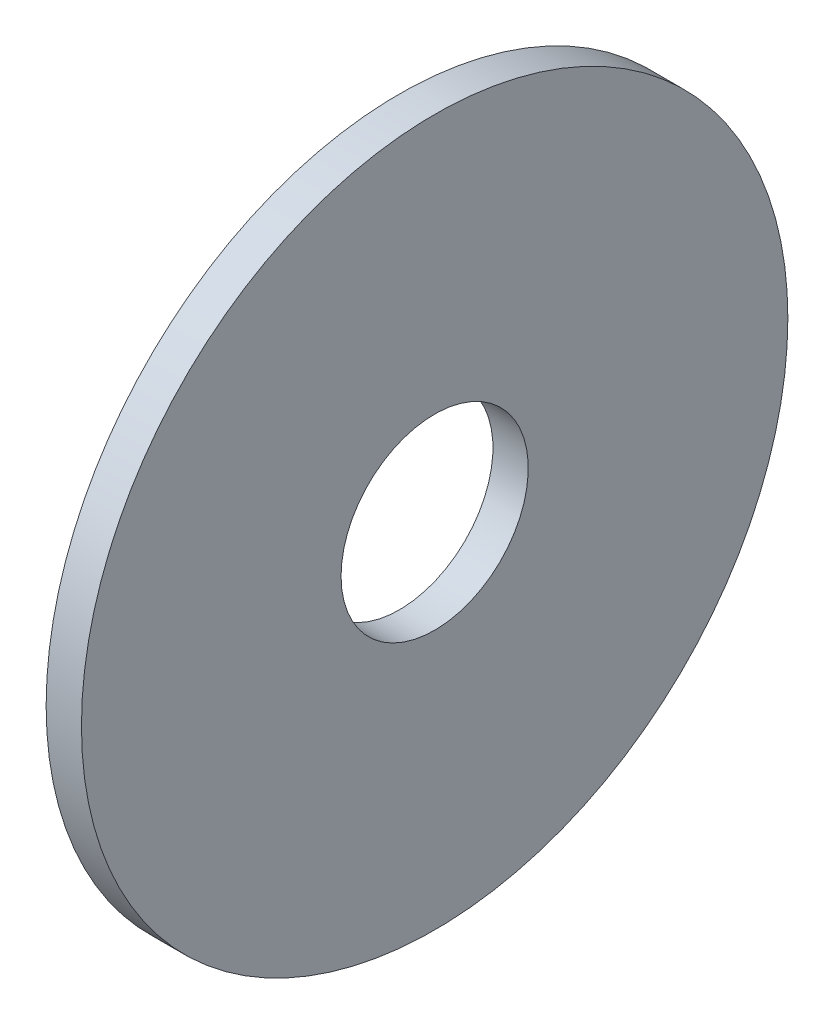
from build123d import *

# Parameters (mm, degrees)
ESQUISSE1_W = 1
ESQUISSE1_H = 7.35


with BuildPart() as part:
    # Esquisse1 → Base-R_volution (revolve)
    with BuildSketch(Plane(origin=(0, 0, 0), x_dir=(1, 0, 0), z_dir=(0, 1, 0)), mode=Mode.PRIVATE) as base_r_volution_sk:
        with Locations((0.5, 6.325)):
            Rectangle(ESQUISSE1_W, ESQUISSE1_H)
    revolve(base_r_volution_sk.sketch.rotate(Axis((0, 0, 0), (1, 0, 0)), 180), axis=Axis((0, 0, 0), (1, 0, 0)))


solid = part.part
